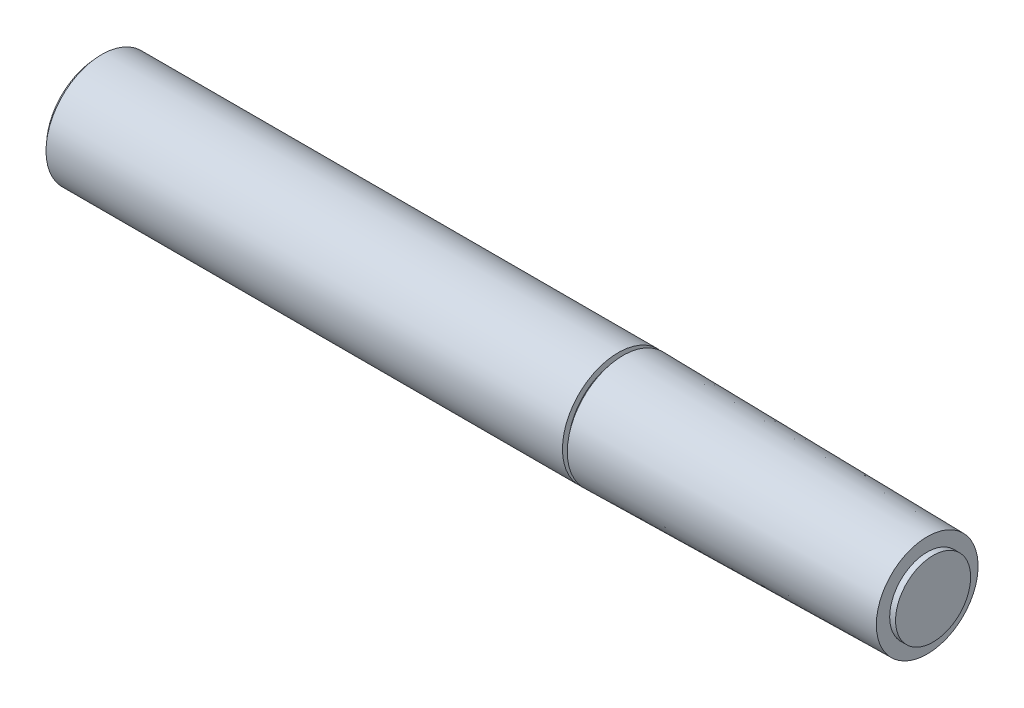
ISO-10303-21;
HEADER;
FILE_DESCRIPTION(('STEP AP214'),'2;1');
FILE_NAME('part.step','',(''),(''),'','','');
FILE_SCHEMA(('AUTOMOTIVE_DESIGN { 1 0 10303 214 1 1 1 1 }'));
ENDSEC;
DATA;
#1=APPLICATION_CONTEXT('core data for automotive mechanical design processes');
#2=APPLICATION_PROTOCOL_DEFINITION('international standard','automotive_design',2000,#1);
#3=PRODUCT_CONTEXT('',#1,'mechanical');
#4=PRODUCT('Part','Part','',(#3));
#5=PRODUCT_RELATED_PRODUCT_CATEGORY('part','',(#4));
#6=PRODUCT_DEFINITION_FORMATION('','',#4);
#7=PRODUCT_DEFINITION_CONTEXT('part definition',#1,'design');
#8=PRODUCT_DEFINITION('design','',#6,#7);
#9=PRODUCT_DEFINITION_SHAPE('','',#8);
#10=(LENGTH_UNIT() NAMED_UNIT(*) SI_UNIT(.MILLI.,.METRE.));
#11=(NAMED_UNIT(*) PLANE_ANGLE_UNIT() SI_UNIT($,.RADIAN.));
#12=(NAMED_UNIT(*) SI_UNIT($,.STERADIAN.) SOLID_ANGLE_UNIT());
#13=UNCERTAINTY_MEASURE_WITH_UNIT(LENGTH_MEASURE(1.E-05),#10,'distance_accuracy_value','');
#14=(GEOMETRIC_REPRESENTATION_CONTEXT(3) GLOBAL_UNCERTAINTY_ASSIGNED_CONTEXT((#13)) GLOBAL_UNIT_ASSIGNED_CONTEXT((#10,
#11,#12)) REPRESENTATION_CONTEXT('',''));
#15=CARTESIAN_POINT('',(0.,0.,0.));
#16=DIRECTION('',(0.,0.,1.));
#17=DIRECTION('',(1.,0.,0.));
#18=AXIS2_PLACEMENT_3D('',#15,#16,#17);
#19=CARTESIAN_POINT('',(26.,0.,0.));
#20=DIRECTION('',(-1.,0.,0.));
#21=DIRECTION('',(0.,0.,1.));
#22=AXIS2_PLACEMENT_3D('',#19,#20,#21);
#23=PLANE('',#22);
#24=CARTESIAN_POINT('',(26.,0.,0.));
#25=DIRECTION('',(-1.,0.,0.));
#26=DIRECTION('',(0.,0.,1.));
#27=AXIS2_PLACEMENT_3D('',#24,#25,#26);
#28=CIRCLE('',#27,3.1);
#29=CARTESIAN_POINT('',(26.,0.,3.1));
#30=VERTEX_POINT('',#29);
#31=EDGE_CURVE('E10',#30,#30,#28,.T.);
#32=ORIENTED_EDGE('',*,*,#31,.F.);
#33=EDGE_LOOP('',(#32));
#34=FACE_BOUND('',#33,.T.);
#35=ADVANCED_FACE('F24',(#34),#23,.F.);
#36=CARTESIAN_POINT('',(-50.4399476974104,0.,0.));
#37=DIRECTION('',(-1.,0.,0.));
#38=DIRECTION('',(0.,0.,1.));
#39=AXIS2_PLACEMENT_3D('',#36,#37,#38);
#40=CYLINDRICAL_SURFACE('',#39,3.1);
#41=CARTESIAN_POINT('',(25.5164769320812,0.,0.));
#42=DIRECTION('',(-1.,0.,0.));
#43=DIRECTION('',(0.,0.,1.));
#44=AXIS2_PLACEMENT_3D('',#41,#42,#43);
#45=CIRCLE('',#44,3.1);
#46=CARTESIAN_POINT('',(25.5164769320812,0.,3.1));
#47=VERTEX_POINT('',#46);
#48=EDGE_CURVE('E30',#47,#47,#45,.T.);
#49=ORIENTED_EDGE('',*,*,#48,.F.);
#50=EDGE_LOOP('',(#49));
#51=FACE_BOUND('',#50,.T.);
#52=ORIENTED_EDGE('',*,*,#31,.T.);
#53=EDGE_LOOP('',(#52));
#54=FACE_BOUND('',#53,.T.);
#55=ADVANCED_FACE('F108',(#51,#54),#40,.T.);
#56=CARTESIAN_POINT('',(25.5164769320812,3.1,0.));
#57=DIRECTION('',(-1.,0.,0.));
#58=DIRECTION('',(0.,0.,1.));
#59=AXIS2_PLACEMENT_3D('',#56,#57,#58);
#60=PLANE('',#59);
#61=CARTESIAN_POINT('',(25.5164769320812,0.,0.));
#62=DIRECTION('',(-1.,0.,0.));
#63=DIRECTION('',(0.,0.,1.));
#64=AXIS2_PLACEMENT_3D('',#61,#62,#63);
#65=CIRCLE('',#64,4.2);
#66=CARTESIAN_POINT('',(25.5164769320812,0.,4.2));
#67=VERTEX_POINT('',#66);
#68=EDGE_CURVE('E34',#67,#67,#65,.T.);
#69=ORIENTED_EDGE('',*,*,#68,.F.);
#70=EDGE_LOOP('',(#69));
#71=FACE_BOUND('',#70,.T.);
#72=ORIENTED_EDGE('',*,*,#48,.T.);
#73=EDGE_LOOP('',(#72));
#74=FACE_BOUND('',#73,.T.);
#75=ADVANCED_FACE('F103',(#71,#74),#60,.F.);
#76=CARTESIAN_POINT('',(25.5164769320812,0.,0.));
#77=DIRECTION('',(-1.,0.,0.));
#78=DIRECTION('',(0.,0.,1.));
#79=AXIS2_PLACEMENT_3D('',#76,#77,#78);
#80=CONICAL_SURFACE('',#79,4.2,0.0159572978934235);
#81=CARTESIAN_POINT('',(0.401287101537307,0.,0.));
#82=DIRECTION('',(-1.,0.,0.));
#83=DIRECTION('',(0.,0.,1.));
#84=AXIS2_PLACEMENT_3D('',#81,#82,#83);
#85=CIRCLE('',#84,4.60080458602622);
#86=CARTESIAN_POINT('',(0.401287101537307,0.,4.60080458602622));
#87=VERTEX_POINT('',#86);
#88=EDGE_CURVE('E38',#87,#87,#85,.T.);
#89=ORIENTED_EDGE('',*,*,#88,.F.);
#90=EDGE_LOOP('',(#89));
#91=FACE_BOUND('',#90,.T.);
#92=ORIENTED_EDGE('',*,*,#68,.T.);
#93=EDGE_LOOP('',(#92));
#94=FACE_BOUND('',#93,.T.);
#95=ADVANCED_FACE('F97',(#91,#94),#80,.T.);
#96=CARTESIAN_POINT('',(0.401287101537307,4.60080458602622,0.));
#97=DIRECTION('',(1.,0.,0.));
#98=DIRECTION('',(0.,0.,-1.));
#99=AXIS2_PLACEMENT_3D('',#96,#97,#98);
#100=PLANE('',#99);
#101=CARTESIAN_POINT('',(0.401287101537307,0.,0.));
#102=DIRECTION('',(-1.,0.,0.));
#103=DIRECTION('',(0.,0.,1.));
#104=AXIS2_PLACEMENT_3D('',#101,#102,#103);
#105=CIRCLE('',#104,4.10693449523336);
#106=CARTESIAN_POINT('',(0.401287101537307,0.,4.10693449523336));
#107=VERTEX_POINT('',#106);
#108=EDGE_CURVE('E43',#107,#107,#105,.T.);
#109=ORIENTED_EDGE('',*,*,#108,.F.);
#110=EDGE_LOOP('',(#109));
#111=FACE_BOUND('',#110,.T.);
#112=ORIENTED_EDGE('',*,*,#88,.T.);
#113=EDGE_LOOP('',(#112));
#114=FACE_BOUND('',#113,.T.);
#115=ADVANCED_FACE('F91',(#111,#114),#100,.F.);
#116=CARTESIAN_POINT('',(-50.4399476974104,0.,0.));
#117=DIRECTION('',(-1.,0.,0.));
#118=DIRECTION('',(0.,0.,1.));
#119=AXIS2_PLACEMENT_3D('',#116,#117,#118);
#120=CYLINDRICAL_SURFACE('',#119,4.10693449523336);
#121=CARTESIAN_POINT('',(0.,0.,0.));
#122=DIRECTION('',(-1.,0.,0.));
#123=DIRECTION('',(0.,0.,1.));
#124=AXIS2_PLACEMENT_3D('',#121,#122,#123);
#125=CIRCLE('',#124,4.10693449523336);
#126=CARTESIAN_POINT('',(0.,0.,4.10693449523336));
#127=VERTEX_POINT('',#126);
#128=EDGE_CURVE('E46',#127,#127,#125,.T.);
#129=ORIENTED_EDGE('',*,*,#128,.F.);
#130=EDGE_LOOP('',(#129));
#131=FACE_BOUND('',#130,.T.);
#132=ORIENTED_EDGE('',*,*,#108,.T.);
#133=EDGE_LOOP('',(#132));
#134=FACE_BOUND('',#133,.T.);
#135=ADVANCED_FACE('F85',(#131,#134),#120,.T.);
#136=CARTESIAN_POINT('',(0.,4.10693449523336,0.));
#137=DIRECTION('',(-1.,0.,0.));
#138=DIRECTION('',(0.,0.,1.));
#139=AXIS2_PLACEMENT_3D('',#136,#137,#138);
#140=PLANE('',#139);
#141=CARTESIAN_POINT('',(0.,0.,0.));
#142=DIRECTION('',(-1.,0.,0.));
#143=DIRECTION('',(0.,0.,1.));
#144=AXIS2_PLACEMENT_3D('',#141,#142,#143);
#145=CIRCLE('',#144,4.60080458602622);
#146=CARTESIAN_POINT('',(0.,0.,4.60080458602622));
#147=VERTEX_POINT('',#146);
#148=EDGE_CURVE('E49',#147,#147,#145,.T.);
#149=ORIENTED_EDGE('',*,*,#148,.F.);
#150=EDGE_LOOP('',(#149));
#151=FACE_BOUND('',#150,.T.);
#152=ORIENTED_EDGE('',*,*,#128,.T.);
#153=EDGE_LOOP('',(#152));
#154=FACE_BOUND('',#153,.T.);
#155=ADVANCED_FACE('F79',(#151,#154),#140,.F.);
#156=CARTESIAN_POINT('',(-50.4399476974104,0.,0.));
#157=DIRECTION('',(-1.,0.,0.));
#158=DIRECTION('',(0.,0.,1.));
#159=AXIS2_PLACEMENT_3D('',#156,#157,#158);
#160=CYLINDRICAL_SURFACE('',#159,4.60080458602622);
#161=CARTESIAN_POINT('',(-42.6399183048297,0.,0.));
#162=DIRECTION('',(-1.,0.,0.));
#163=DIRECTION('',(0.,0.,1.));
#164=AXIS2_PLACEMENT_3D('',#161,#162,#163);
#165=CIRCLE('',#164,4.60080458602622);
#166=CARTESIAN_POINT('',(-42.6399183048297,0.,4.60080458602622));
#167=VERTEX_POINT('',#166);
#168=EDGE_CURVE('E52',#167,#167,#165,.T.);
#169=ORIENTED_EDGE('',*,*,#168,.F.);
#170=EDGE_LOOP('',(#169));
#171=FACE_BOUND('',#170,.T.);
#172=ORIENTED_EDGE('',*,*,#148,.T.);
#173=EDGE_LOOP('',(#172));
#174=FACE_BOUND('',#173,.T.);
#175=ADVANCED_FACE('F73',(#171,#174),#160,.T.);
#176=CARTESIAN_POINT('',(-42.6399183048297,4.60080458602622,0.));
#177=DIRECTION('',(1.,0.,0.));
#178=DIRECTION('',(0.,0.,-1.));
#179=AXIS2_PLACEMENT_3D('',#176,#177,#178);
#180=PLANE('',#179);
#181=CARTESIAN_POINT('',(-42.6399183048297,0.,0.));
#182=DIRECTION('',(-1.,0.,0.));
#183=DIRECTION('',(0.,0.,1.));
#184=AXIS2_PLACEMENT_3D('',#181,#182,#183);
#185=CIRCLE('',#184,4.2);
#186=CARTESIAN_POINT('',(-42.6399183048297,0.,4.2));
#187=VERTEX_POINT('',#186);
#188=EDGE_CURVE('E55',#187,#187,#185,.T.);
#189=ORIENTED_EDGE('',*,*,#188,.F.);
#190=EDGE_LOOP('',(#189));
#191=FACE_BOUND('',#190,.T.);
#192=ORIENTED_EDGE('',*,*,#168,.T.);
#193=EDGE_LOOP('',(#192));
#194=FACE_BOUND('',#193,.T.);
#195=ADVANCED_FACE('F67',(#191,#194),#180,.F.);
#196=CARTESIAN_POINT('',(-50.4399476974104,0.,0.));
#197=DIRECTION('',(-1.,0.,0.));
#198=DIRECTION('',(0.,0.,1.));
#199=AXIS2_PLACEMENT_3D('',#196,#197,#198);
#200=CYLINDRICAL_SURFACE('',#199,4.2);
#201=CARTESIAN_POINT('',(-43.,0.,0.));
#202=DIRECTION('',(-1.,0.,0.));
#203=DIRECTION('',(0.,0.,1.));
#204=AXIS2_PLACEMENT_3D('',#201,#202,#203);
#205=CIRCLE('',#204,4.2);
#206=CARTESIAN_POINT('',(-43.,0.,4.2));
#207=VERTEX_POINT('',#206);
#208=EDGE_CURVE('E58',#207,#207,#205,.T.);
#209=ORIENTED_EDGE('',*,*,#208,.F.);
#210=EDGE_LOOP('',(#209));
#211=FACE_BOUND('',#210,.T.);
#212=ORIENTED_EDGE('',*,*,#188,.T.);
#213=EDGE_LOOP('',(#212));
#214=FACE_BOUND('',#213,.T.);
#215=ADVANCED_FACE('F64',(#211,#214),#200,.T.);
#216=CARTESIAN_POINT('',(-43.,4.2,0.));
#217=DIRECTION('',(1.,0.,0.));
#218=DIRECTION('',(0.,0.,-1.));
#219=AXIS2_PLACEMENT_3D('',#216,#217,#218);
#220=PLANE('',#219);
#221=ORIENTED_EDGE('',*,*,#208,.T.);
#222=EDGE_LOOP('',(#221));
#223=FACE_BOUND('',#222,.T.);
#224=ADVANCED_FACE('F62',(#223),#220,.F.);
#225=CLOSED_SHELL('',(#35,#55,#75,#95,#115,#135,#155,#175,#195,#215,#224));
#226=MANIFOLD_SOLID_BREP('B2',#225);
#227=ADVANCED_BREP_SHAPE_REPRESENTATION('',(#18,#226),#14);
#228=SHAPE_DEFINITION_REPRESENTATION(#9,#227);
ENDSEC;
END-ISO-10303-21;
